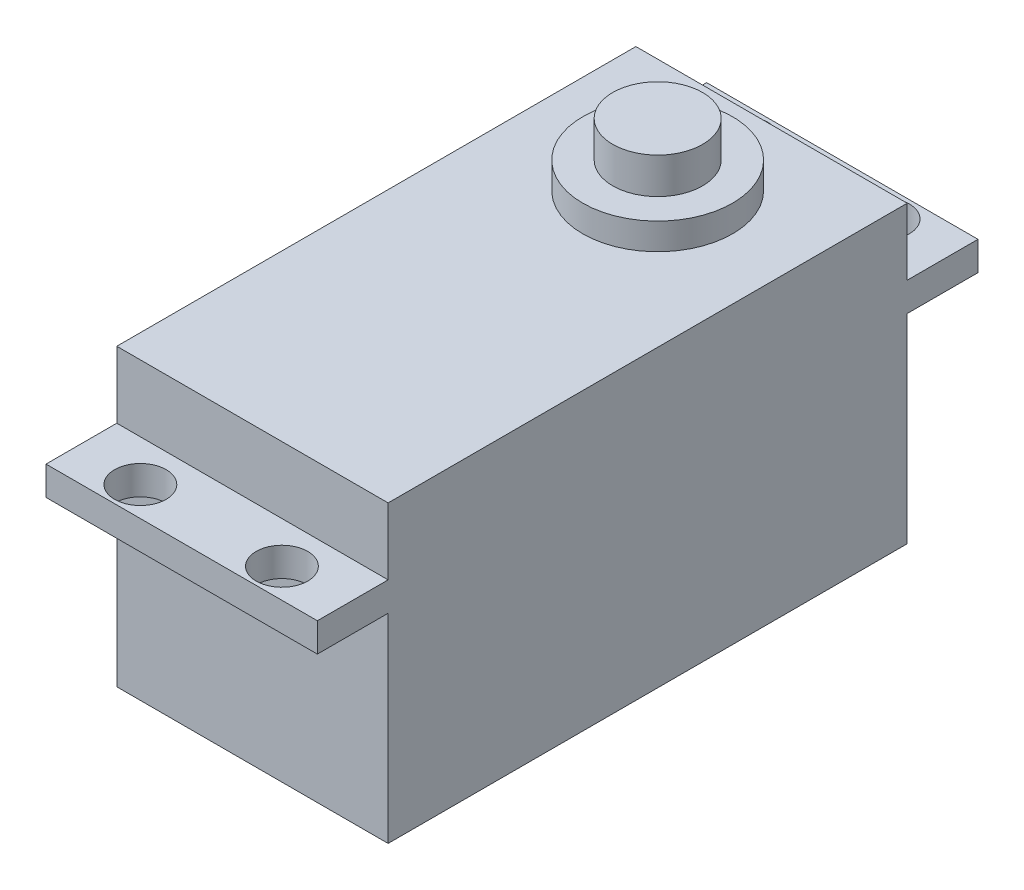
ISO-10303-21;
HEADER;
FILE_DESCRIPTION(('STEP AP214'),'2;1');
FILE_NAME('part.step','',(''),(''),'','','');
FILE_SCHEMA(('AUTOMOTIVE_DESIGN { 1 0 10303 214 1 1 1 1 }'));
ENDSEC;
DATA;
#1=APPLICATION_CONTEXT('core data for automotive mechanical design processes');
#2=APPLICATION_PROTOCOL_DEFINITION('international standard','automotive_design',2000,#1);
#3=PRODUCT_CONTEXT('',#1,'mechanical');
#4=PRODUCT('Part','Part','',(#3));
#5=PRODUCT_RELATED_PRODUCT_CATEGORY('part','',(#4));
#6=PRODUCT_DEFINITION_FORMATION('','',#4);
#7=PRODUCT_DEFINITION_CONTEXT('part definition',#1,'design');
#8=PRODUCT_DEFINITION('design','',#6,#7);
#9=PRODUCT_DEFINITION_SHAPE('','',#8);
#10=(LENGTH_UNIT() NAMED_UNIT(*) SI_UNIT(.MILLI.,.METRE.));
#11=(NAMED_UNIT(*) PLANE_ANGLE_UNIT() SI_UNIT($,.RADIAN.));
#12=(NAMED_UNIT(*) SI_UNIT($,.STERADIAN.) SOLID_ANGLE_UNIT());
#13=UNCERTAINTY_MEASURE_WITH_UNIT(LENGTH_MEASURE(1.E-05),#10,'distance_accuracy_value','');
#14=(GEOMETRIC_REPRESENTATION_CONTEXT(3) GLOBAL_UNCERTAINTY_ASSIGNED_CONTEXT((#13)) GLOBAL_UNIT_ASSIGNED_CONTEXT((#10,
#11,#12)) REPRESENTATION_CONTEXT('',''));
#15=CARTESIAN_POINT('',(0.,0.,0.));
#16=DIRECTION('',(0.,0.,1.));
#17=DIRECTION('',(1.,0.,0.));
#18=AXIS2_PLACEMENT_3D('',#15,#16,#17);
#19=CARTESIAN_POINT('',(0.,27.252,-12.348));
#20=DIRECTION('',(0.,1.,0.));
#21=DIRECTION('',(0.,0.,1.));
#22=AXIS2_PLACEMENT_3D('',#19,#20,#21);
#23=PLANE('',#22);
#24=CARTESIAN_POINT('',(0.,27.252,-12.348));
#25=DIRECTION('',(0.,1.,0.));
#26=DIRECTION('',(0.,0.,1.));
#27=AXIS2_PLACEMENT_3D('',#24,#25,#26);
#28=CIRCLE('',#27,6.35);
#29=CARTESIAN_POINT('',(0.,27.252,-5.998));
#30=VERTEX_POINT('',#29);
#31=EDGE_CURVE('E248',#30,#30,#28,.T.);
#32=ORIENTED_EDGE('',*,*,#31,.T.);
#33=EDGE_LOOP('',(#32));
#34=FACE_BOUND('',#33,.T.);
#35=CARTESIAN_POINT('',(0.,27.252,-12.348));
#36=DIRECTION('',(0.,1.,0.));
#37=DIRECTION('',(0.,0.,1.));
#38=AXIS2_PLACEMENT_3D('',#35,#36,#37);
#39=CIRCLE('',#38,3.81);
#40=CARTESIAN_POINT('',(0.,27.252,-16.158));
#41=VERTEX_POINT('',#40);
#42=EDGE_CURVE('E256',#41,#41,#39,.T.);
#43=ORIENTED_EDGE('',*,*,#42,.F.);
#44=EDGE_LOOP('',(#43));
#45=FACE_BOUND('',#44,.T.);
#46=ADVANCED_FACE('F31',(#34,#45),#23,.T.);
#47=CARTESIAN_POINT('',(-11.5,25.,22.));
#48=DIRECTION('',(0.,1.,0.));
#49=DIRECTION('',(0.,0.,1.));
#50=AXIS2_PLACEMENT_3D('',#47,#48,#49);
#51=PLANE('',#50);
#52=DIRECTION('',(0.,0.,1.));
#53=VECTOR('',#52,1.);
#54=CARTESIAN_POINT('',(-11.5,25.,-22.));
#55=LINE('',#54,#53);
#56=CARTESIAN_POINT('',(-11.5,25.,-22.));
#57=VERTEX_POINT('',#56);
#58=CARTESIAN_POINT('',(-11.5,25.,22.));
#59=VERTEX_POINT('',#58);
#60=EDGE_CURVE('E457',#57,#59,#55,.T.);
#61=ORIENTED_EDGE('',*,*,#60,.T.);
#62=DIRECTION('',(1.,0.,0.));
#63=VECTOR('',#62,1.);
#64=CARTESIAN_POINT('',(-11.5,25.,22.));
#65=LINE('',#64,#63);
#66=CARTESIAN_POINT('',(11.5,25.,22.));
#67=VERTEX_POINT('',#66);
#68=EDGE_CURVE('E490',#59,#67,#65,.T.);
#69=ORIENTED_EDGE('',*,*,#68,.T.);
#70=DIRECTION('',(0.,0.,-1.));
#71=VECTOR('',#70,1.);
#72=CARTESIAN_POINT('',(11.5,25.,-22.));
#73=LINE('',#72,#71);
#74=CARTESIAN_POINT('',(11.5,25.,-22.));
#75=VERTEX_POINT('',#74);
#76=EDGE_CURVE('E491',#67,#75,#73,.T.);
#77=ORIENTED_EDGE('',*,*,#76,.T.);
#78=DIRECTION('',(-1.,0.,0.));
#79=VECTOR('',#78,1.);
#80=CARTESIAN_POINT('',(-11.5,25.,-22.));
#81=LINE('',#80,#79);
#82=EDGE_CURVE('E451',#75,#57,#81,.T.);
#83=ORIENTED_EDGE('',*,*,#82,.T.);
#84=EDGE_LOOP('',(#61,#69,#77,#83));
#85=FACE_BOUND('',#84,.T.);
#86=CARTESIAN_POINT('',(0.,25.,-12.348));
#87=DIRECTION('',(0.,1.,0.));
#88=DIRECTION('',(0.,0.,1.));
#89=AXIS2_PLACEMENT_3D('',#86,#87,#88);
#90=CIRCLE('',#89,6.35);
#91=CARTESIAN_POINT('',(0.,25.,-5.998));
#92=VERTEX_POINT('',#91);
#93=EDGE_CURVE('E251',#92,#92,#90,.T.);
#94=ORIENTED_EDGE('',*,*,#93,.F.);
#95=EDGE_LOOP('',(#94));
#96=FACE_BOUND('',#95,.T.);
#97=ADVANCED_FACE('F211',(#85,#96),#51,.T.);
#98=CARTESIAN_POINT('',(-11.5,16.9,28.));
#99=DIRECTION('',(0.,1.,0.));
#100=DIRECTION('',(0.,0.,1.));
#101=AXIS2_PLACEMENT_3D('',#98,#99,#100);
#102=PLANE('',#101);
#103=DIRECTION('',(1.,0.,0.));
#104=VECTOR('',#103,1.);
#105=CARTESIAN_POINT('',(-11.5,16.9,22.));
#106=LINE('',#105,#104);
#107=CARTESIAN_POINT('',(-11.5,16.9,22.));
#108=VERTEX_POINT('',#107);
#109=CARTESIAN_POINT('',(11.5,16.9,22.));
#110=VERTEX_POINT('',#109);
#111=EDGE_CURVE('E56',#108,#110,#106,.T.);
#112=ORIENTED_EDGE('',*,*,#111,.T.);
#113=DIRECTION('',(0.,0.,-1.));
#114=VECTOR('',#113,1.);
#115=CARTESIAN_POINT('',(11.5,16.9,28.));
#116=LINE('',#115,#114);
#117=CARTESIAN_POINT('',(11.5,16.9,28.));
#118=VERTEX_POINT('',#117);
#119=EDGE_CURVE('E448',#118,#110,#116,.T.);
#120=ORIENTED_EDGE('',*,*,#119,.F.);
#121=DIRECTION('',(1.,0.,0.));
#122=VECTOR('',#121,1.);
#123=CARTESIAN_POINT('',(-11.5,16.9,28.));
#124=LINE('',#123,#122);
#125=CARTESIAN_POINT('',(-11.5,16.9,28.));
#126=VERTEX_POINT('',#125);
#127=EDGE_CURVE('E518',#126,#118,#124,.T.);
#128=ORIENTED_EDGE('',*,*,#127,.F.);
#129=DIRECTION('',(0.,0.,-1.));
#130=VECTOR('',#129,1.);
#131=CARTESIAN_POINT('',(-11.5,16.9,28.));
#132=LINE('',#131,#130);
#133=EDGE_CURVE('E443',#126,#108,#132,.T.);
#134=ORIENTED_EDGE('',*,*,#133,.T.);
#135=EDGE_LOOP('',(#112,#120,#128,#134));
#136=FACE_BOUND('',#135,.T.);
#137=CARTESIAN_POINT('',(6.,16.9,25.5));
#138=DIRECTION('',(0.,1.,0.));
#139=DIRECTION('',(0.,0.,1.));
#140=AXIS2_PLACEMENT_3D('',#137,#138,#139);
#141=CIRCLE('',#140,2.1844);
#142=CARTESIAN_POINT('',(6.,16.9,27.6844));
#143=VERTEX_POINT('',#142);
#144=EDGE_CURVE('E157',#143,#143,#141,.T.);
#145=ORIENTED_EDGE('',*,*,#144,.T.);
#146=EDGE_LOOP('',(#145));
#147=FACE_BOUND('',#146,.T.);
#148=CARTESIAN_POINT('',(-6.,16.9,25.5));
#149=DIRECTION('',(0.,1.,0.));
#150=DIRECTION('',(0.,0.,1.));
#151=AXIS2_PLACEMENT_3D('',#148,#149,#150);
#152=CIRCLE('',#151,2.1844);
#153=CARTESIAN_POINT('',(-6.,16.9,27.6844));
#154=VERTEX_POINT('',#153);
#155=EDGE_CURVE('E242',#154,#154,#152,.F.);
#156=ORIENTED_EDGE('',*,*,#155,.F.);
#157=EDGE_LOOP('',(#156));
#158=FACE_BOUND('',#157,.T.);
#159=ADVANCED_FACE('F193',(#136,#147,#158),#102,.F.);
#160=CARTESIAN_POINT('',(-11.5,19.35,28.));
#161=DIRECTION('',(0.,-1.,0.));
#162=DIRECTION('',(0.,0.,-1.));
#163=AXIS2_PLACEMENT_3D('',#160,#161,#162);
#164=PLANE('',#163);
#165=DIRECTION('',(-1.,0.,0.));
#166=VECTOR('',#165,1.);
#167=CARTESIAN_POINT('',(-11.5,19.35,22.));
#168=LINE('',#167,#166);
#169=CARTESIAN_POINT('',(11.5,19.35,22.));
#170=VERTEX_POINT('',#169);
#171=CARTESIAN_POINT('',(-11.5,19.35,22.));
#172=VERTEX_POINT('',#171);
#173=EDGE_CURVE('E477',#170,#172,#168,.T.);
#174=ORIENTED_EDGE('',*,*,#173,.T.);
#175=DIRECTION('',(0.,0.,-1.));
#176=VECTOR('',#175,1.);
#177=CARTESIAN_POINT('',(-11.5,19.35,28.));
#178=LINE('',#177,#176);
#179=CARTESIAN_POINT('',(-11.5,19.35,28.));
#180=VERTEX_POINT('',#179);
#181=EDGE_CURVE('E471',#180,#172,#178,.T.);
#182=ORIENTED_EDGE('',*,*,#181,.F.);
#183=DIRECTION('',(-1.,0.,0.));
#184=VECTOR('',#183,1.);
#185=CARTESIAN_POINT('',(-11.5,19.35,28.));
#186=LINE('',#185,#184);
#187=CARTESIAN_POINT('',(11.5,19.35,28.));
#188=VERTEX_POINT('',#187);
#189=EDGE_CURVE('E476',#188,#180,#186,.T.);
#190=ORIENTED_EDGE('',*,*,#189,.F.);
#191=DIRECTION('',(0.,0.,-1.));
#192=VECTOR('',#191,1.);
#193=CARTESIAN_POINT('',(11.5,19.35,28.));
#194=LINE('',#193,#192);
#195=EDGE_CURVE('E468',#188,#170,#194,.T.);
#196=ORIENTED_EDGE('',*,*,#195,.T.);
#197=EDGE_LOOP('',(#174,#182,#190,#196));
#198=FACE_BOUND('',#197,.T.);
#199=CARTESIAN_POINT('',(6.,19.35,25.5));
#200=DIRECTION('',(0.,1.,0.));
#201=DIRECTION('',(0.,0.,1.));
#202=AXIS2_PLACEMENT_3D('',#199,#200,#201);
#203=CIRCLE('',#202,2.1844);
#204=CARTESIAN_POINT('',(6.,19.35,27.6844));
#205=VERTEX_POINT('',#204);
#206=EDGE_CURVE('E177',#205,#205,#203,.T.);
#207=ORIENTED_EDGE('',*,*,#206,.F.);
#208=EDGE_LOOP('',(#207));
#209=FACE_BOUND('',#208,.T.);
#210=CARTESIAN_POINT('',(-6.,19.35,25.5));
#211=DIRECTION('',(0.,-1.,0.));
#212=DIRECTION('',(0.,0.,1.));
#213=AXIS2_PLACEMENT_3D('',#210,#211,#212);
#214=CIRCLE('',#213,2.1844);
#215=CARTESIAN_POINT('',(-6.,19.35,27.6844));
#216=VERTEX_POINT('',#215);
#217=EDGE_CURVE('E244',#216,#216,#214,.T.);
#218=ORIENTED_EDGE('',*,*,#217,.T.);
#219=EDGE_LOOP('',(#218));
#220=FACE_BOUND('',#219,.T.);
#221=ADVANCED_FACE('F326',(#198,#209,#220),#164,.F.);
#222=CARTESIAN_POINT('',(-11.5,19.35,-28.));
#223=DIRECTION('',(0.,1.,0.));
#224=DIRECTION('',(0.,0.,1.));
#225=AXIS2_PLACEMENT_3D('',#222,#223,#224);
#226=PLANE('',#225);
#227=CARTESIAN_POINT('',(-6.,19.35,-25.5));
#228=DIRECTION('',(0.,1.,0.));
#229=DIRECTION('',(0.,0.,-1.));
#230=AXIS2_PLACEMENT_3D('',#227,#228,#229);
#231=CIRCLE('',#230,2.1844);
#232=CARTESIAN_POINT('',(-6.,19.35,-27.6844));
#233=VERTEX_POINT('',#232);
#234=EDGE_CURVE('E187',#233,#233,#231,.T.);
#235=ORIENTED_EDGE('',*,*,#234,.F.);
#236=EDGE_LOOP('',(#235));
#237=FACE_BOUND('',#236,.T.);
#238=DIRECTION('',(-1.,0.,0.));
#239=VECTOR('',#238,1.);
#240=CARTESIAN_POINT('',(-11.5,19.35,-22.));
#241=LINE('',#240,#239);
#242=CARTESIAN_POINT('',(11.5,19.35,-22.));
#243=VERTEX_POINT('',#242);
#244=CARTESIAN_POINT('',(-11.5,19.35,-22.));
#245=VERTEX_POINT('',#244);
#246=EDGE_CURVE('E155',#243,#245,#241,.T.);
#247=ORIENTED_EDGE('',*,*,#246,.F.);
#248=DIRECTION('',(0.,0.,1.));
#249=VECTOR('',#248,1.);
#250=CARTESIAN_POINT('',(11.5,19.35,-28.));
#251=LINE('',#250,#249);
#252=CARTESIAN_POINT('',(11.5,19.35,-28.));
#253=VERTEX_POINT('',#252);
#254=EDGE_CURVE('E129',#253,#243,#251,.T.);
#255=ORIENTED_EDGE('',*,*,#254,.F.);
#256=DIRECTION('',(-1.,0.,0.));
#257=VECTOR('',#256,1.);
#258=CARTESIAN_POINT('',(-11.5,19.35,-28.));
#259=LINE('',#258,#257);
#260=CARTESIAN_POINT('',(-11.5,19.35,-28.));
#261=VERTEX_POINT('',#260);
#262=EDGE_CURVE('E135',#253,#261,#259,.T.);
#263=ORIENTED_EDGE('',*,*,#262,.T.);
#264=DIRECTION('',(0.,0.,1.));
#265=VECTOR('',#264,1.);
#266=CARTESIAN_POINT('',(-11.5,19.35,-28.));
#267=LINE('',#266,#265);
#268=EDGE_CURVE('E48',#261,#245,#267,.T.);
#269=ORIENTED_EDGE('',*,*,#268,.T.);
#270=EDGE_LOOP('',(#247,#255,#263,#269));
#271=FACE_BOUND('',#270,.T.);
#272=CARTESIAN_POINT('',(6.,19.35,-25.5));
#273=DIRECTION('',(0.,-1.,0.));
#274=DIRECTION('',(0.,0.,-1.));
#275=AXIS2_PLACEMENT_3D('',#272,#273,#274);
#276=CIRCLE('',#275,2.1844);
#277=CARTESIAN_POINT('',(6.,19.35,-27.6844));
#278=VERTEX_POINT('',#277);
#279=EDGE_CURVE('E178',#278,#278,#276,.T.);
#280=ORIENTED_EDGE('',*,*,#279,.T.);
#281=EDGE_LOOP('',(#280));
#282=FACE_BOUND('',#281,.T.);
#283=ADVANCED_FACE('F141',(#237,#271,#282),#226,.T.);
#284=CARTESIAN_POINT('',(-11.5,16.9,-28.));
#285=DIRECTION('',(0.,-1.,0.));
#286=DIRECTION('',(0.,0.,-1.));
#287=AXIS2_PLACEMENT_3D('',#284,#285,#286);
#288=PLANE('',#287);
#289=CARTESIAN_POINT('',(-6.,16.9,-25.5));
#290=DIRECTION('',(0.,-1.,0.));
#291=DIRECTION('',(0.,0.,-1.));
#292=AXIS2_PLACEMENT_3D('',#289,#290,#291);
#293=CIRCLE('',#292,2.1844);
#294=CARTESIAN_POINT('',(-6.,16.9,-27.6844));
#295=VERTEX_POINT('',#294);
#296=EDGE_CURVE('E35',#295,#295,#293,.T.);
#297=ORIENTED_EDGE('',*,*,#296,.F.);
#298=EDGE_LOOP('',(#297));
#299=FACE_BOUND('',#298,.T.);
#300=DIRECTION('',(1.,0.,0.));
#301=VECTOR('',#300,1.);
#302=CARTESIAN_POINT('',(-11.5,16.9,-22.));
#303=LINE('',#302,#301);
#304=CARTESIAN_POINT('',(-11.5,16.9,-22.));
#305=VERTEX_POINT('',#304);
#306=CARTESIAN_POINT('',(11.5,16.9,-22.));
#307=VERTEX_POINT('',#306);
#308=EDGE_CURVE('E139',#305,#307,#303,.T.);
#309=ORIENTED_EDGE('',*,*,#308,.F.);
#310=DIRECTION('',(0.,0.,1.));
#311=VECTOR('',#310,1.);
#312=CARTESIAN_POINT('',(-11.5,16.9,-28.));
#313=LINE('',#312,#311);
#314=CARTESIAN_POINT('',(-11.5,16.9,-28.));
#315=VERTEX_POINT('',#314);
#316=EDGE_CURVE('E149',#315,#305,#313,.T.);
#317=ORIENTED_EDGE('',*,*,#316,.F.);
#318=DIRECTION('',(1.,0.,0.));
#319=VECTOR('',#318,1.);
#320=CARTESIAN_POINT('',(-11.5,16.9,-28.));
#321=LINE('',#320,#319);
#322=CARTESIAN_POINT('',(11.5,16.9,-28.));
#323=VERTEX_POINT('',#322);
#324=EDGE_CURVE('E138',#315,#323,#321,.T.);
#325=ORIENTED_EDGE('',*,*,#324,.T.);
#326=DIRECTION('',(0.,0.,1.));
#327=VECTOR('',#326,1.);
#328=CARTESIAN_POINT('',(11.5,16.9,-28.));
#329=LINE('',#328,#327);
#330=EDGE_CURVE('E165',#323,#307,#329,.T.);
#331=ORIENTED_EDGE('',*,*,#330,.T.);
#332=EDGE_LOOP('',(#309,#317,#325,#331));
#333=FACE_BOUND('',#332,.T.);
#334=CARTESIAN_POINT('',(6.,16.9,-25.5));
#335=DIRECTION('',(0.,-1.,0.));
#336=DIRECTION('',(0.,0.,-1.));
#337=AXIS2_PLACEMENT_3D('',#334,#335,#336);
#338=CIRCLE('',#337,2.1844);
#339=CARTESIAN_POINT('',(6.,16.9,-27.6844));
#340=VERTEX_POINT('',#339);
#341=EDGE_CURVE('E175',#340,#340,#338,.F.);
#342=ORIENTED_EDGE('',*,*,#341,.T.);
#343=EDGE_LOOP('',(#342));
#344=FACE_BOUND('',#343,.T.);
#345=ADVANCED_FACE('F309',(#299,#333,#344),#288,.T.);
#346=CARTESIAN_POINT('',(-11.5,25.,-22.));
#347=DIRECTION('',(0.,0.,1.));
#348=DIRECTION('',(1.,0.,0.));
#349=AXIS2_PLACEMENT_3D('',#346,#347,#348);
#350=PLANE('',#349);
#351=DIRECTION('',(0.,-1.,0.));
#352=VECTOR('',#351,1.);
#353=CARTESIAN_POINT('',(-11.5,25.,-22.));
#354=LINE('',#353,#352);
#355=CARTESIAN_POINT('',(-11.5,0.,-22.));
#356=VERTEX_POINT('',#355);
#357=EDGE_CURVE('E463',#305,#356,#354,.T.);
#358=ORIENTED_EDGE('',*,*,#357,.F.);
#359=ORIENTED_EDGE('',*,*,#308,.T.);
#360=DIRECTION('',(0.,-1.,0.));
#361=VECTOR('',#360,1.);
#362=CARTESIAN_POINT('',(11.5,25.,-22.));
#363=LINE('',#362,#361);
#364=CARTESIAN_POINT('',(11.5,0.,-22.));
#365=VERTEX_POINT('',#364);
#366=EDGE_CURVE('E158',#307,#365,#363,.T.);
#367=ORIENTED_EDGE('',*,*,#366,.T.);
#368=DIRECTION('',(-1.,0.,0.));
#369=VECTOR('',#368,1.);
#370=CARTESIAN_POINT('',(-11.5,0.,-22.));
#371=LINE('',#370,#369);
#372=EDGE_CURVE('E440',#365,#356,#371,.T.);
#373=ORIENTED_EDGE('',*,*,#372,.T.);
#374=EDGE_LOOP('',(#358,#359,#367,#373));
#375=FACE_BOUND('',#374,.T.);
#376=ADVANCED_FACE('F314',(#375),#350,.F.);
#377=CARTESIAN_POINT('',(-11.5,25.,22.));
#378=DIRECTION('',(0.,0.,-1.));
#379=DIRECTION('',(-1.,0.,0.));
#380=AXIS2_PLACEMENT_3D('',#377,#378,#379);
#381=PLANE('',#380);
#382=ORIENTED_EDGE('',*,*,#173,.F.);
#383=DIRECTION('',(0.,-1.,0.));
#384=VECTOR('',#383,1.);
#385=CARTESIAN_POINT('',(11.5,25.,22.));
#386=LINE('',#385,#384);
#387=EDGE_CURVE('E503',#67,#170,#386,.T.);
#388=ORIENTED_EDGE('',*,*,#387,.F.);
#389=ORIENTED_EDGE('',*,*,#68,.F.);
#390=DIRECTION('',(0.,-1.,0.));
#391=VECTOR('',#390,1.);
#392=CARTESIAN_POINT('',(-11.5,25.,22.));
#393=LINE('',#392,#391);
#394=EDGE_CURVE('E11',#59,#172,#393,.T.);
#395=ORIENTED_EDGE('',*,*,#394,.T.);
#396=EDGE_LOOP('',(#382,#388,#389,#395));
#397=FACE_BOUND('',#396,.T.);
#398=ADVANCED_FACE('F401',(#397),#381,.F.);
#399=ORIENTED_EDGE('',*,*,#111,.F.);
#400=CARTESIAN_POINT('',(-11.5,0.,22.));
#401=VERTEX_POINT('',#400);
#402=EDGE_CURVE('E40',#108,#401,#393,.T.);
#403=ORIENTED_EDGE('',*,*,#402,.T.);
#404=DIRECTION('',(1.,0.,0.));
#405=VECTOR('',#404,1.);
#406=CARTESIAN_POINT('',(-11.5,0.,22.));
#407=LINE('',#406,#405);
#408=CARTESIAN_POINT('',(11.5,0.,22.));
#409=VERTEX_POINT('',#408);
#410=EDGE_CURVE('E442',#401,#409,#407,.T.);
#411=ORIENTED_EDGE('',*,*,#410,.T.);
#412=EDGE_CURVE('E500',#110,#409,#386,.T.);
#413=ORIENTED_EDGE('',*,*,#412,.F.);
#414=EDGE_LOOP('',(#399,#403,#411,#413));
#415=FACE_BOUND('',#414,.T.);
#416=ADVANCED_FACE('F392',(#415),#381,.F.);
#417=CARTESIAN_POINT('',(-11.5,25.,-22.));
#418=DIRECTION('',(1.,0.,0.));
#419=DIRECTION('',(0.,0.,-1.));
#420=AXIS2_PLACEMENT_3D('',#417,#418,#419);
#421=PLANE('',#420);
#422=DIRECTION('',(0.,0.,1.));
#423=VECTOR('',#422,1.);
#424=CARTESIAN_POINT('',(-11.5,0.,-22.));
#425=LINE('',#424,#423);
#426=EDGE_CURVE('E437',#356,#401,#425,.T.);
#427=ORIENTED_EDGE('',*,*,#426,.T.);
#428=ORIENTED_EDGE('',*,*,#402,.F.);
#429=ORIENTED_EDGE('',*,*,#133,.F.);
#430=DIRECTION('',(0.,-1.,0.));
#431=VECTOR('',#430,1.);
#432=CARTESIAN_POINT('',(-11.5,19.35,28.));
#433=LINE('',#432,#431);
#434=EDGE_CURVE('E481',#180,#126,#433,.T.);
#435=ORIENTED_EDGE('',*,*,#434,.F.);
#436=ORIENTED_EDGE('',*,*,#181,.T.);
#437=ORIENTED_EDGE('',*,*,#394,.F.);
#438=ORIENTED_EDGE('',*,*,#60,.F.);
#439=EDGE_CURVE('E128',#57,#245,#354,.T.);
#440=ORIENTED_EDGE('',*,*,#439,.T.);
#441=ORIENTED_EDGE('',*,*,#268,.F.);
#442=DIRECTION('',(0.,-1.,0.));
#443=VECTOR('',#442,1.);
#444=CARTESIAN_POINT('',(-11.5,19.35,-28.));
#445=LINE('',#444,#443);
#446=EDGE_CURVE('E124',#261,#315,#445,.T.);
#447=ORIENTED_EDGE('',*,*,#446,.T.);
#448=ORIENTED_EDGE('',*,*,#316,.T.);
#449=ORIENTED_EDGE('',*,*,#357,.T.);
#450=EDGE_LOOP('',(#427,#428,#429,#435,#436,#437,#438,#440,#441,#447,#448,#449));
#451=FACE_BOUND('',#450,.T.);
#452=ADVANCED_FACE('F33',(#451),#421,.F.);
#453=CARTESIAN_POINT('',(11.5,25.,-22.));
#454=DIRECTION('',(-1.,0.,0.));
#455=DIRECTION('',(0.,0.,1.));
#456=AXIS2_PLACEMENT_3D('',#453,#454,#455);
#457=PLANE('',#456);
#458=DIRECTION('',(0.,0.,-1.));
#459=VECTOR('',#458,1.);
#460=CARTESIAN_POINT('',(11.5,0.,-22.));
#461=LINE('',#460,#459);
#462=EDGE_CURVE('E445',#409,#365,#461,.T.);
#463=ORIENTED_EDGE('',*,*,#462,.T.);
#464=ORIENTED_EDGE('',*,*,#366,.F.);
#465=ORIENTED_EDGE('',*,*,#330,.F.);
#466=DIRECTION('',(0.,1.,0.));
#467=VECTOR('',#466,1.);
#468=CARTESIAN_POINT('',(11.5,19.35,-28.));
#469=LINE('',#468,#467);
#470=EDGE_CURVE('E143',#323,#253,#469,.T.);
#471=ORIENTED_EDGE('',*,*,#470,.T.);
#472=ORIENTED_EDGE('',*,*,#254,.T.);
#473=EDGE_CURVE('E498',#75,#243,#363,.T.);
#474=ORIENTED_EDGE('',*,*,#473,.F.);
#475=ORIENTED_EDGE('',*,*,#76,.F.);
#476=ORIENTED_EDGE('',*,*,#387,.T.);
#477=ORIENTED_EDGE('',*,*,#195,.F.);
#478=DIRECTION('',(0.,1.,0.));
#479=VECTOR('',#478,1.);
#480=CARTESIAN_POINT('',(11.5,19.35,28.));
#481=LINE('',#480,#479);
#482=EDGE_CURVE('E523',#118,#188,#481,.T.);
#483=ORIENTED_EDGE('',*,*,#482,.F.);
#484=ORIENTED_EDGE('',*,*,#119,.T.);
#485=ORIENTED_EDGE('',*,*,#412,.T.);
#486=EDGE_LOOP('',(#463,#464,#465,#471,#472,#474,#475,#476,#477,#483,#484,#485));
#487=FACE_BOUND('',#486,.T.);
#488=ADVANCED_FACE('F370',(#487),#457,.F.);
#489=ORIENTED_EDGE('',*,*,#473,.T.);
#490=ORIENTED_EDGE('',*,*,#246,.T.);
#491=ORIENTED_EDGE('',*,*,#439,.F.);
#492=ORIENTED_EDGE('',*,*,#82,.F.);
#493=EDGE_LOOP('',(#489,#490,#491,#492));
#494=FACE_BOUND('',#493,.T.);
#495=ADVANCED_FACE('F364',(#494),#350,.F.);
#496=CARTESIAN_POINT('',(-11.5,0.,22.));
#497=DIRECTION('',(0.,1.,0.));
#498=DIRECTION('',(0.,0.,1.));
#499=AXIS2_PLACEMENT_3D('',#496,#497,#498);
#500=PLANE('',#499);
#501=ORIENTED_EDGE('',*,*,#426,.F.);
#502=ORIENTED_EDGE('',*,*,#372,.F.);
#503=ORIENTED_EDGE('',*,*,#462,.F.);
#504=ORIENTED_EDGE('',*,*,#410,.F.);
#505=EDGE_LOOP('',(#501,#502,#503,#504));
#506=FACE_BOUND('',#505,.T.);
#507=ADVANCED_FACE('F369',(#506),#500,.F.);
#508=CARTESIAN_POINT('',(-11.5,16.9,28.));
#509=DIRECTION('',(0.,0.,1.));
#510=DIRECTION('',(1.,0.,0.));
#511=AXIS2_PLACEMENT_3D('',#508,#509,#510);
#512=PLANE('',#511);
#513=ORIENTED_EDGE('',*,*,#434,.T.);
#514=ORIENTED_EDGE('',*,*,#127,.T.);
#515=ORIENTED_EDGE('',*,*,#482,.T.);
#516=ORIENTED_EDGE('',*,*,#189,.T.);
#517=EDGE_LOOP('',(#513,#514,#515,#516));
#518=FACE_BOUND('',#517,.T.);
#519=ADVANCED_FACE('F208',(#518),#512,.T.);
#520=CARTESIAN_POINT('',(-11.5,16.9,-28.));
#521=DIRECTION('',(0.,0.,-1.));
#522=DIRECTION('',(1.,0.,0.));
#523=AXIS2_PLACEMENT_3D('',#520,#521,#522);
#524=PLANE('',#523);
#525=ORIENTED_EDGE('',*,*,#446,.F.);
#526=ORIENTED_EDGE('',*,*,#262,.F.);
#527=ORIENTED_EDGE('',*,*,#470,.F.);
#528=ORIENTED_EDGE('',*,*,#324,.F.);
#529=EDGE_LOOP('',(#525,#526,#527,#528));
#530=FACE_BOUND('',#529,.T.);
#531=ADVANCED_FACE('F133',(#530),#524,.T.);
#532=CARTESIAN_POINT('',(6.,-2.50000000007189E-05,25.5));
#533=DIRECTION('',(0.,1.,0.));
#534=DIRECTION('',(0.,0.,1.));
#535=AXIS2_PLACEMENT_3D('',#532,#533,#534);
#536=CYLINDRICAL_SURFACE('',#535,2.1844);
#537=ORIENTED_EDGE('',*,*,#206,.T.);
#538=EDGE_LOOP('',(#537));
#539=FACE_BOUND('',#538,.T.);
#540=ORIENTED_EDGE('',*,*,#144,.F.);
#541=EDGE_LOOP('',(#540));
#542=FACE_BOUND('',#541,.T.);
#543=ADVANCED_FACE('F196',(#539,#542),#536,.F.);
#544=CARTESIAN_POINT('',(6.,-2.50000000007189E-05,-25.5));
#545=DIRECTION('',(0.,1.,0.));
#546=DIRECTION('',(0.,0.,1.));
#547=AXIS2_PLACEMENT_3D('',#544,#545,#546);
#548=CYLINDRICAL_SURFACE('',#547,2.1844);
#549=ORIENTED_EDGE('',*,*,#341,.F.);
#550=EDGE_LOOP('',(#549));
#551=FACE_BOUND('',#550,.T.);
#552=ORIENTED_EDGE('',*,*,#279,.F.);
#553=EDGE_LOOP('',(#552));
#554=FACE_BOUND('',#553,.T.);
#555=ADVANCED_FACE('F198',(#551,#554),#548,.F.);
#556=CARTESIAN_POINT('',(-6.,-2.50000000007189E-05,-25.5));
#557=DIRECTION('',(0.,1.,0.));
#558=DIRECTION('',(0.,0.,1.));
#559=AXIS2_PLACEMENT_3D('',#556,#557,#558);
#560=CYLINDRICAL_SURFACE('',#559,2.1844);
#561=ORIENTED_EDGE('',*,*,#296,.T.);
#562=EDGE_LOOP('',(#561));
#563=FACE_BOUND('',#562,.T.);
#564=ORIENTED_EDGE('',*,*,#234,.T.);
#565=EDGE_LOOP('',(#564));
#566=FACE_BOUND('',#565,.T.);
#567=ADVANCED_FACE('F205',(#563,#566),#560,.F.);
#568=CARTESIAN_POINT('',(-6.,-2.50000000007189E-05,25.5));
#569=DIRECTION('',(0.,1.,0.));
#570=DIRECTION('',(0.,0.,1.));
#571=AXIS2_PLACEMENT_3D('',#568,#569,#570);
#572=CYLINDRICAL_SURFACE('',#571,2.1844);
#573=ORIENTED_EDGE('',*,*,#217,.F.);
#574=EDGE_LOOP('',(#573));
#575=FACE_BOUND('',#574,.T.);
#576=ORIENTED_EDGE('',*,*,#155,.T.);
#577=EDGE_LOOP('',(#576));
#578=FACE_BOUND('',#577,.T.);
#579=ADVANCED_FACE('F228',(#575,#578),#572,.F.);
#580=CARTESIAN_POINT('',(0.,27.252,-12.348));
#581=DIRECTION('',(0.,-1.,0.));
#582=DIRECTION('',(0.,0.,-1.));
#583=AXIS2_PLACEMENT_3D('',#580,#581,#582);
#584=CYLINDRICAL_SURFACE('',#583,6.35);
#585=ORIENTED_EDGE('',*,*,#31,.F.);
#586=EDGE_LOOP('',(#585));
#587=FACE_BOUND('',#586,.T.);
#588=ORIENTED_EDGE('',*,*,#93,.T.);
#589=EDGE_LOOP('',(#588));
#590=FACE_BOUND('',#589,.T.);
#591=ADVANCED_FACE('F225',(#587,#590),#584,.T.);
#592=CARTESIAN_POINT('',(0.,30.3,-12.348));
#593=DIRECTION('',(0.,-1.,0.));
#594=DIRECTION('',(0.,0.,-1.));
#595=AXIS2_PLACEMENT_3D('',#592,#593,#594);
#596=CYLINDRICAL_SURFACE('',#595,3.81);
#597=CARTESIAN_POINT('',(0.,30.3,-12.348));
#598=DIRECTION('',(0.,1.,0.));
#599=DIRECTION('',(0.,0.,1.));
#600=AXIS2_PLACEMENT_3D('',#597,#598,#599);
#601=CIRCLE('',#600,3.81);
#602=CARTESIAN_POINT('',(0.,30.3,-16.158));
#603=VERTEX_POINT('',#602);
#604=EDGE_CURVE('E254',#603,#603,#601,.T.);
#605=CARTESIAN_POINT('',(0.,30.3,-16.158));
#606=CARTESIAN_POINT('',(0.,30.26825,-16.158));
#607=CARTESIAN_POINT('',(0.,30.2365,-16.158));
#608=CARTESIAN_POINT('',(0.,30.173,-16.158));
#609=CARTESIAN_POINT('',(0.,30.14125,-16.158));
#610=CARTESIAN_POINT('',(0.,30.07775,-16.158));
#611=CARTESIAN_POINT('',(0.,30.046,-16.158));
#612=CARTESIAN_POINT('',(0.,29.9825,-16.158));
#613=CARTESIAN_POINT('',(0.,29.95075,-16.158));
#614=CARTESIAN_POINT('',(0.,29.88725,-16.158));
#615=CARTESIAN_POINT('',(0.,29.8555,-16.158));
#616=CARTESIAN_POINT('',(0.,29.792,-16.158));
#617=CARTESIAN_POINT('',(0.,29.76025,-16.158));
#618=CARTESIAN_POINT('',(0.,29.69675,-16.158));
#619=CARTESIAN_POINT('',(0.,29.665,-16.158));
#620=CARTESIAN_POINT('',(0.,29.6015,-16.158));
#621=CARTESIAN_POINT('',(0.,29.56975,-16.158));
#622=CARTESIAN_POINT('',(0.,29.50625,-16.158));
#623=CARTESIAN_POINT('',(0.,29.4745,-16.158));
#624=CARTESIAN_POINT('',(0.,29.411,-16.158));
#625=CARTESIAN_POINT('',(0.,29.37925,-16.158));
#626=CARTESIAN_POINT('',(0.,29.31575,-16.158));
#627=CARTESIAN_POINT('',(0.,29.284,-16.158));
#628=CARTESIAN_POINT('',(0.,29.2205,-16.158));
#629=CARTESIAN_POINT('',(0.,29.18875,-16.158));
#630=CARTESIAN_POINT('',(0.,29.12525,-16.158));
#631=CARTESIAN_POINT('',(0.,29.0935,-16.158));
#632=CARTESIAN_POINT('',(0.,29.03,-16.158));
#633=CARTESIAN_POINT('',(0.,28.99825,-16.158));
#634=CARTESIAN_POINT('',(0.,28.93475,-16.158));
#635=CARTESIAN_POINT('',(0.,28.903,-16.158));
#636=CARTESIAN_POINT('',(0.,28.8395,-16.158));
#637=CARTESIAN_POINT('',(0.,28.80775,-16.158));
#638=CARTESIAN_POINT('',(0.,28.74425,-16.158));
#639=CARTESIAN_POINT('',(0.,28.7125,-16.158));
#640=CARTESIAN_POINT('',(0.,28.649,-16.158));
#641=CARTESIAN_POINT('',(0.,28.61725,-16.158));
#642=CARTESIAN_POINT('',(0.,28.55375,-16.158));
#643=CARTESIAN_POINT('',(0.,28.522,-16.158));
#644=CARTESIAN_POINT('',(0.,28.4585,-16.158));
#645=CARTESIAN_POINT('',(0.,28.42675,-16.158));
#646=CARTESIAN_POINT('',(0.,28.36325,-16.158));
#647=CARTESIAN_POINT('',(0.,28.3315,-16.158));
#648=CARTESIAN_POINT('',(0.,28.268,-16.158));
#649=CARTESIAN_POINT('',(0.,28.23625,-16.158));
#650=CARTESIAN_POINT('',(0.,28.17275,-16.158));
#651=CARTESIAN_POINT('',(0.,28.141,-16.158));
#652=CARTESIAN_POINT('',(0.,28.0775,-16.158));
#653=CARTESIAN_POINT('',(0.,28.04575,-16.158));
#654=CARTESIAN_POINT('',(0.,27.98225,-16.158));
#655=CARTESIAN_POINT('',(0.,27.9505,-16.158));
#656=CARTESIAN_POINT('',(0.,27.887,-16.158));
#657=CARTESIAN_POINT('',(0.,27.85525,-16.158));
#658=CARTESIAN_POINT('',(0.,27.79175,-16.158));
#659=CARTESIAN_POINT('',(0.,27.76,-16.158));
#660=CARTESIAN_POINT('',(0.,27.6965,-16.158));
#661=CARTESIAN_POINT('',(0.,27.66475,-16.158));
#662=CARTESIAN_POINT('',(0.,27.60125,-16.158));
#663=CARTESIAN_POINT('',(0.,27.5695,-16.158));
#664=CARTESIAN_POINT('',(0.,27.506,-16.158));
#665=CARTESIAN_POINT('',(0.,27.47425,-16.158));
#666=CARTESIAN_POINT('',(0.,27.41075,-16.158));
#667=CARTESIAN_POINT('',(0.,27.379,-16.158));
#668=CARTESIAN_POINT('',(0.,27.3155,-16.158));
#669=CARTESIAN_POINT('',(0.,27.28375,-16.158));
#670=CARTESIAN_POINT('',(0.,27.252,-16.158));
#671=B_SPLINE_CURVE_WITH_KNOTS('',3,(#605,#606,#607,#608,#609,#610,#611,#612,#613,#614,#615,
#616,#617,#618,#619,#620,#621,#622,#623,#624,#625,#626,#627,#628,#629,#630,#631,#632,#633,#634,
#635,#636,#637,#638,#639,#640,#641,#642,#643,#644,#645,#646,#647,#648,#649,#650,#651,#652,#653,
#654,#655,#656,#657,#658,#659,#660,#661,#662,#663,#664,#665,#666,#667,#668,#669,#670),
.UNSPECIFIED.,.F.,.F.,(4,2,2,2,2,2,2,2,2,2,2,2,2,2,2,2,2,2,2,2,2,2,2,2,2,2,2,2,2,2,2,2,4),(0.,
0.0952500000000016,0.190500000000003,0.285750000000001,0.381000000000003,0.476250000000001,
0.571500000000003,0.666750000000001,0.762000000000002,0.85725,0.952500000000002,1.04775,1.143,
1.23825,1.3335,1.42875,1.524,1.61925,1.7145,1.80975,1.905,2.00025,2.0955,2.19075,2.286,2.38125,
2.4765,2.57175,2.667,2.76225,2.8575,2.95275,3.048),.UNSPECIFIED.);
#672=EDGE_CURVE('BSEAM223',#603,#41,#671,.T.);
#673=ORIENTED_EDGE('',*,*,#604,.F.);
#674=ORIENTED_EDGE('',*,*,#42,.T.);
#675=ORIENTED_EDGE('',*,*,#672,.T.);
#676=ORIENTED_EDGE('',*,*,#672,.F.);
#677=EDGE_LOOP('',(#673,#675,#674,#676));
#678=FACE_BOUND('',#677,.T.);
#679=ADVANCED_FACE('F223',(#678),#596,.T.);
#680=CARTESIAN_POINT('',(0.,30.3,-12.348));
#681=DIRECTION('',(0.,1.,0.));
#682=DIRECTION('',(0.,0.,1.));
#683=AXIS2_PLACEMENT_3D('',#680,#681,#682);
#684=PLANE('',#683);
#685=ORIENTED_EDGE('',*,*,#604,.T.);
#686=EDGE_LOOP('',(#685));
#687=FACE_BOUND('',#686,.T.);
#688=ADVANCED_FACE('F262',(#687),#684,.T.);
#689=CLOSED_SHELL('',(#46,#97,#159,#221,#283,#345,#376,#398,#416,#452,#488,#495,#507,#519,#531,
#543,#555,#567,#579,#591,#679,#688));
#690=MANIFOLD_SOLID_BREP('B2',#689);
#691=ADVANCED_BREP_SHAPE_REPRESENTATION('',(#18,#690),#14);
#692=SHAPE_DEFINITION_REPRESENTATION(#9,#691);
ENDSEC;
END-ISO-10303-21;
